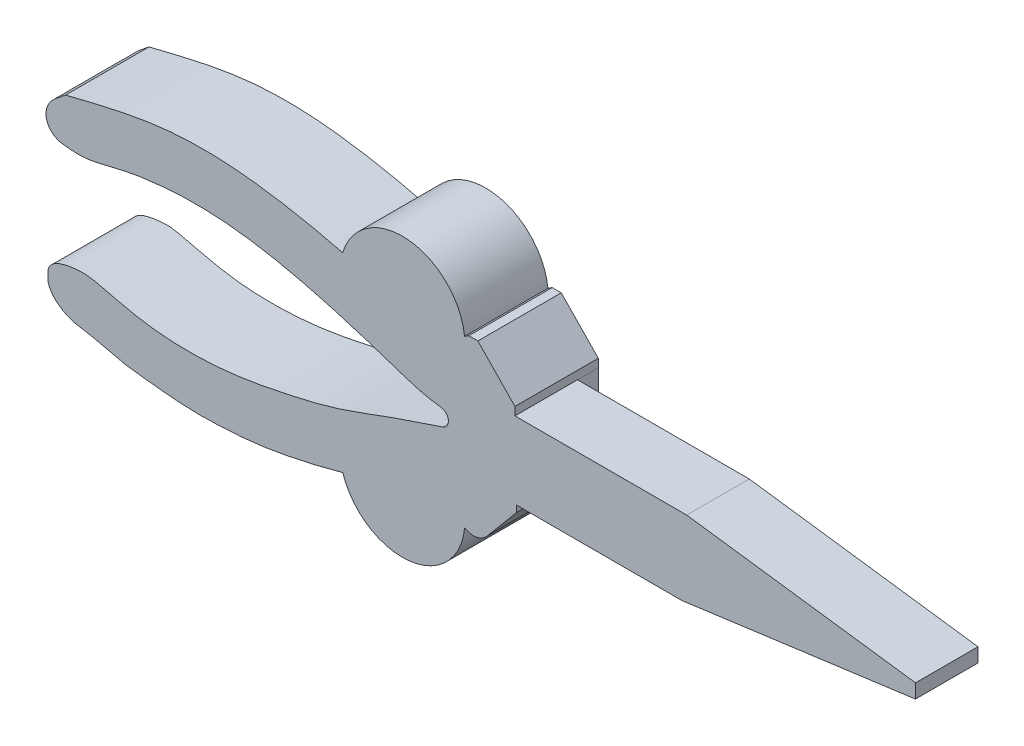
from build123d import *

# Parameters (mm, degrees)
BOSS_EXTRU_1_DEPTH      = 10
BOSS_EXTRU_1_DEPTH_BACK = 10
ENL_V_MAT_EXTRU_1_DEPTH = 5
BOSS_EXTRU_2_DEPTH      = 20


with BuildPart() as part:
    # Esquisse1 → Boss.-Extru.1 (new, two sides: drawn at the far end of the back side and taken through both)
    with BuildSketch(Plane.XY.offset(-BOSS_EXTRU_1_DEPTH_BACK)):
        with BuildLine():
            Line((105.081366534, 58.191832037), (107.251737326, 58.191832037))
            Line((107.251737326, 58.191832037), (116.146968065, 49.033209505))
            Line((116.146968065, 49.033209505), (116.146968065, 47.067778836))
            Line((116.146968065, 47.067778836), (157.355628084, 47.067778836))
            Line((157.355628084, 47.067778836), (212.232944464, 39.650400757))
            Line((212.232944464, 39.650400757), (212.232944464, 36.274476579))
            Line((212.232944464, 36.274476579), (156.209057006, 28.732370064))
            Line((156.209057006, 28.732370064), (116.477456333, 28.732370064))
            Line((116.477456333, 28.732370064), (116.477456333, 27.112420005))
            Line((116.477456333, 27.112420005), (109.42745204, 18.70861054))
            add(Edge.make_bspline(
                [(98.774513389, 36.089574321), (98.3839606, 35.967349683), (96.513340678, 35.354040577), (92.641644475, 33.907402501), (87.409163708, 32.30779124), (79.968528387, 29.482727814), (72.14623885, 26.674676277), (62.472177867, 24.431454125), (54.760170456, 22.815910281), (46.459253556, 21.621270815), (39.45996709, 21.214223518), (31.788963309, 21.4305124), (24.131257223, 22.420382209), (17.921033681, 24.175479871), (13.482122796, 25.04317238), (10.765107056, 24.938584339), (7.991147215, 24.522722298), (5.43195618, 23.541150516), (4.197017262, 22.066259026), (4.048769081, 20.416270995), (4.025915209, 18.575469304), (5.415018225, 16.372260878), (7.678005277, 14.577913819), (10.355683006, 13.505533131), (13.098010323, 13.200323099), (15.698301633, 12.609159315), (18.706769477, 11.961088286), (22.07135887, 11.016546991), (26.46058303, 10.524201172), (32.25770836, 9.880423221), (38.898964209, 9.330619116), (45.787729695, 9.578796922), (53.332130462, 10.030729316), (63.14377103, 11.655736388), (75.037992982, 14.497563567), (84.989578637, 17.813375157), (91.918712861, 20.105883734), (96.2191428, 20.198121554), (99.778311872, 19.571207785), (102.753971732, 18.484286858), (104.69792773, 17.371773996), (107.152854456, 17.008357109), (108.676971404, 17.89894548), (109.42745204, 18.70861054)],
                knots=[0.066692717, 0.066692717, 0.066692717, 0.066692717, 0.072111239, 0.092751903, 0.121627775, 0.14467252, 0.198434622, 0.231751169, 0.276424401, 0.303019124, 0.343035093, 0.369314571, 0.404855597, 0.445144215, 0.455026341, 0.464647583, 0.481051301, 0.492169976, 0.500470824, 0.504660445, 0.513931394, 0.524327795, 0.537758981, 0.551907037, 0.561905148, 0.574300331, 0.587283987, 0.602777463, 0.620601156, 0.645778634, 0.680302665, 0.7088982, 0.737215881, 0.780596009, 0.840739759, 0.899260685, 0.920214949, 0.936982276, 0.95576085, 0.967889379, 0.978912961, 0.985237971, 1, 1, 1, 1], degree=3))
            ThreePointArc((98.774513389, 36.089574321), (100.169456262, 38.173840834), (98.431522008, 39.982049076))
            add(Edge.make_bspline(
                [(8.348991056, 59.829513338), (6.8593439, 58.603941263), (3.852657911, 56.768516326), (3.346617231, 51.909390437), (5.85048187, 49.484898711), (8.572448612, 49.185323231), (11.092342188, 48.960172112), (14.088080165, 49.126393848), (17.612687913, 49.951894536), (21.238704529, 50.847664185), (25.433663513, 51.744134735), (29.379020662, 52.20199272), (33.80978835, 52.687522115), (38.610680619, 52.8490918), (44.79166035, 52.743672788), (51.840809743, 52.048505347), (61.301292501, 50.404507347), (71.07477778, 47.937585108), (80.315812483, 45.122960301), (87.639086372, 42.722808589), (93.330038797, 40.735570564), (97.135855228, 40.148171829), (98.431522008, 39.982049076)],
                knots=[0, 0, 0, 0, 0.049454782, 0.077161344, 0.107433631, 0.122865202, 0.143705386, 0.169550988, 0.195890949, 0.23227824, 0.261148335, 0.300925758, 0.329534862, 0.370371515, 0.418537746, 0.480962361, 0.543734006, 0.653720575, 0.727747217, 0.780389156, 0.842788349, 0.874758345, 0.874758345, 0.874758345, 0.874758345], degree=3))
            add(Edge.make_bspline(
                [(8.348991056, 59.829513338), (16.191705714, 61.759872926), (29.356569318, 65.136567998), (47.918965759, 65.272051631), (65.466329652, 62.729542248), (79.564637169, 59.281721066), (89.883202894, 55.487425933), (94.842436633, 55.067831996), (99.763053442, 55.889942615), (103.260874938, 56.844648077), (105.081366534, 58.191832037)],
                knots=[0, 0, 0, 0, 0.245740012, 0.409223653, 0.559653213, 0.783071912, 0.848769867, 0.891973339, 0.932117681, 1, 1, 1, 1], degree=3))
        make_face()
    extrude(amount=BOSS_EXTRU_1_DEPTH + BOSS_EXTRU_1_DEPTH_BACK)

    # Esquisse2 → Enl_v. mat.-Extru.1 (cut)
    with BuildSketch(Plane(origin=(0, 0, -10), x_dir=(-1, 0, 0), z_dir=(0, 0, -1))):
        Polygon((-116.477456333, 28.732370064), (-156.209057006, 28.732370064), (-212.232944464, 36.274476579), (-212.232944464, 39.650400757), (-157.355628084, 47.067778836), (-116.146968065, 47.067778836), align=None)
    extrude(amount=-ENL_V_MAT_EXTRU_1_DEPTH, mode=Mode.SUBTRACT)

    # Esquisse3 → Boss.-Extru.2 (add)
    with BuildSketch(Plane.XY.offset(10)):
        with BuildLine():
            Line((74.190038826, 54.784865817), (102.669985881, 49.430157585))
            ThreePointArc((102.669985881, 49.430157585), (91.918655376, 70.662466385), (74.190038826, 54.784865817))
        make_face()
        with BuildLine():
            Line((74.190038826, 20.315447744), (102.669985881, 25.670155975))
            ThreePointArc((102.669985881, 25.670155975), (91.918655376, 4.437847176), (74.190038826, 20.315447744))
        make_face()
    extrude(amount=-BOSS_EXTRU_2_DEPTH)


solid = part.part
